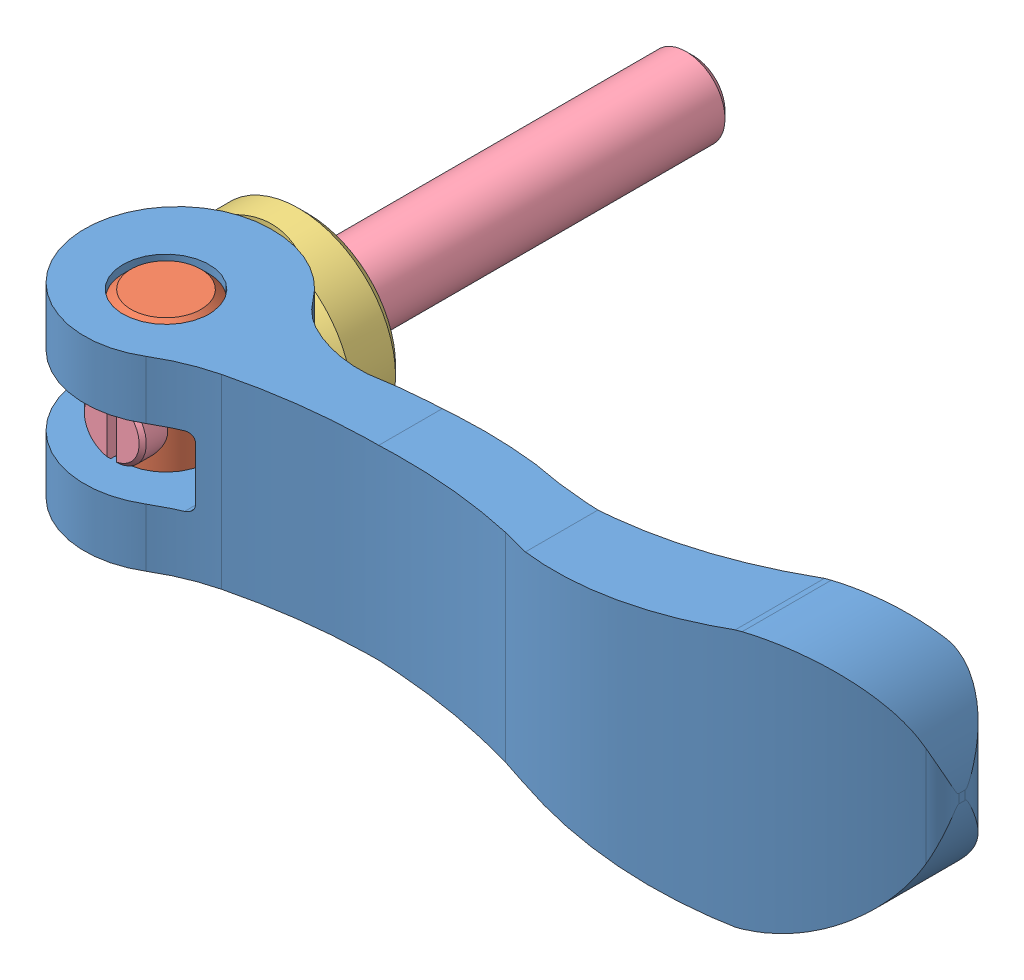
SolidWorks assembly KCLS10X50.SLDASM, configuration Default (file format 15000). Lengths in mm.
Overall size (108.51 33.22 78.5).
4 component instances, 4 part files, 0 mates.
Components (placement in the parent):
- KCLS10X50_01-1: KCLS10X50_01.SLDPRT [ﾃﾞﾌｫﾙﾄ] at (0 0 18.3) x (1 0 0) z (0 -1 0) size (108.01 24 33.22)
- KCLS10X50_02-1: KCLS10X50_02.SLDPRT [ﾃﾞﾌｫﾙﾄ] at (0 0 18.3) x (0 1 0) z (1 0 0) size (24 11 11)
- KCLS10X50_03-1: KCLS10X50_03.SLDPRT [ﾃﾞﾌｫﾙﾄ] x (1 0 0) z (0 -1 0) size (25 8 25)
- KCLS10X50_04-1: KCLS10X50_04.SLDPRT [ﾃﾞﾌｫﾙﾄ] at (0 0 -24.7) x (0 1 0) z (1 0 0) size (10 75 10)
